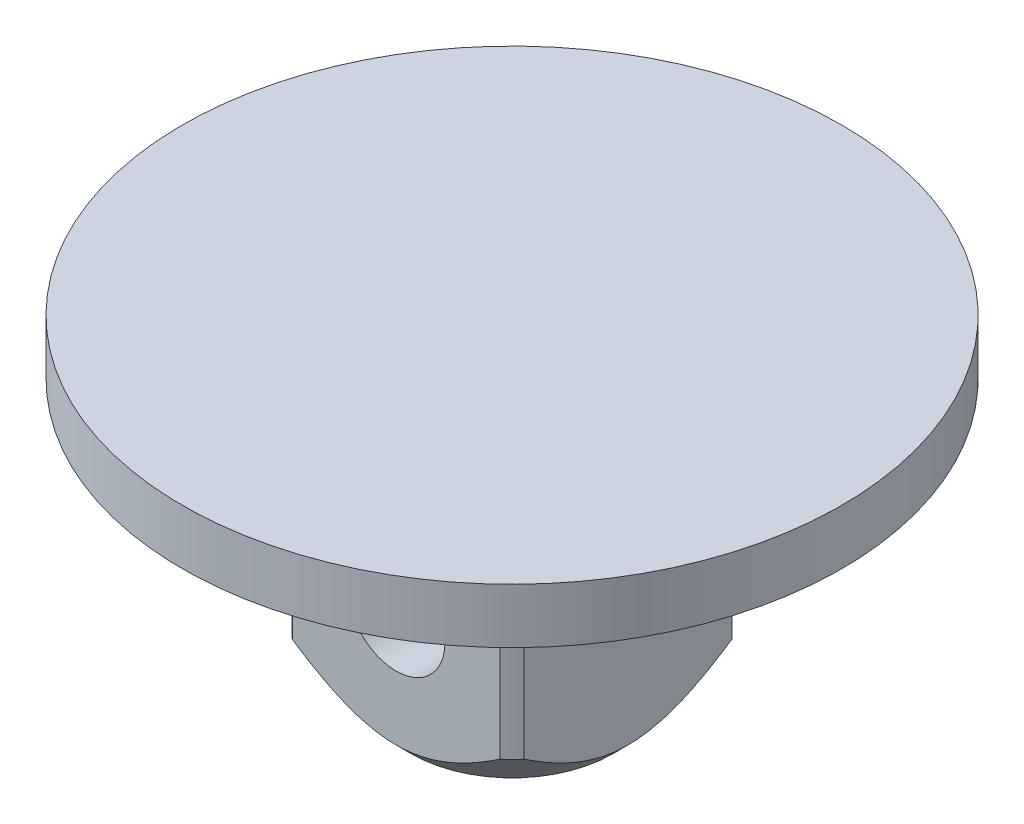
ISO-10303-21;
HEADER;
FILE_DESCRIPTION(('STEP AP214'),'2;1');
FILE_NAME('part.step','',(''),(''),'','','');
FILE_SCHEMA(('AUTOMOTIVE_DESIGN { 1 0 10303 214 1 1 1 1 }'));
ENDSEC;
DATA;
#1=APPLICATION_CONTEXT('core data for automotive mechanical design processes');
#2=APPLICATION_PROTOCOL_DEFINITION('international standard','automotive_design',2000,#1);
#3=PRODUCT_CONTEXT('',#1,'mechanical');
#4=PRODUCT('Part','Part','',(#3));
#5=PRODUCT_RELATED_PRODUCT_CATEGORY('part','',(#4));
#6=PRODUCT_DEFINITION_FORMATION('','',#4);
#7=PRODUCT_DEFINITION_CONTEXT('part definition',#1,'design');
#8=PRODUCT_DEFINITION('design','',#6,#7);
#9=PRODUCT_DEFINITION_SHAPE('','',#8);
#10=(LENGTH_UNIT() NAMED_UNIT(*) SI_UNIT(.MILLI.,.METRE.));
#11=(NAMED_UNIT(*) PLANE_ANGLE_UNIT() SI_UNIT($,.RADIAN.));
#12=(NAMED_UNIT(*) SI_UNIT($,.STERADIAN.) SOLID_ANGLE_UNIT());
#13=UNCERTAINTY_MEASURE_WITH_UNIT(LENGTH_MEASURE(1.E-05),#10,'distance_accuracy_value','');
#14=(GEOMETRIC_REPRESENTATION_CONTEXT(3) GLOBAL_UNCERTAINTY_ASSIGNED_CONTEXT((#13)) GLOBAL_UNIT_ASSIGNED_CONTEXT((#10,
#11,#12)) REPRESENTATION_CONTEXT('',''));
#15=CARTESIAN_POINT('',(0.,0.,0.));
#16=DIRECTION('',(0.,0.,1.));
#17=DIRECTION('',(1.,0.,0.));
#18=AXIS2_PLACEMENT_3D('',#15,#16,#17);
#19=CARTESIAN_POINT('',(0.,0.,0.));
#20=DIRECTION('',(0.,-1.,0.));
#21=DIRECTION('',(0.,0.,-1.));
#22=AXIS2_PLACEMENT_3D('',#19,#20,#21);
#23=CYLINDRICAL_SURFACE('',#22,12.75);
#24=CARTESIAN_POINT('',(0.,0.,0.));
#25=DIRECTION('',(0.,-1.,0.));
#26=DIRECTION('',(0.,0.,-1.));
#27=AXIS2_PLACEMENT_3D('',#24,#25,#26);
#28=CIRCLE('',#27,12.75);
#29=CARTESIAN_POINT('',(0.,0.,-12.75));
#30=VERTEX_POINT('',#29);
#31=EDGE_CURVE('E151',#30,#30,#28,.T.);
#32=ORIENTED_EDGE('',*,*,#31,.T.);
#33=EDGE_LOOP('',(#32));
#34=FACE_BOUND('',#33,.T.);
#35=CARTESIAN_POINT('',(0.,-18.,0.));
#36=DIRECTION('',(0.,-1.,0.));
#37=DIRECTION('',(0.,0.,-1.));
#38=AXIS2_PLACEMENT_3D('',#35,#36,#37);
#39=CIRCLE('',#38,12.75);
#40=CARTESIAN_POINT('',(8.50367567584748,-18.,9.5));
#41=VERTEX_POINT('',#40);
#42=CARTESIAN_POINT('',(9.5,-18.,8.50367567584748));
#43=VERTEX_POINT('',#42);
#44=EDGE_CURVE('E395',#41,#43,#39,.F.);
#45=ORIENTED_EDGE('',*,*,#44,.T.);
#46=DIRECTION('',(0.,-1.,0.));
#47=VECTOR('',#46,1.);
#48=CARTESIAN_POINT('',(9.5,0.,8.50367567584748));
#49=LINE('',#48,#47);
#50=CARTESIAN_POINT('',(9.5,-1.5,8.50367567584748));
#51=VERTEX_POINT('',#50);
#52=EDGE_CURVE('E61',#43,#51,#49,.F.);
#53=ORIENTED_EDGE('',*,*,#52,.T.);
#54=CARTESIAN_POINT('',(0.,-1.5,0.));
#55=DIRECTION('',(0.,-1.,0.));
#56=DIRECTION('',(0.,0.,-1.));
#57=AXIS2_PLACEMENT_3D('',#54,#55,#56);
#58=CIRCLE('',#57,12.75);
#59=CARTESIAN_POINT('',(9.5,-1.5,-8.50367567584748));
#60=VERTEX_POINT('',#59);
#61=EDGE_CURVE('E12',#51,#60,#58,.F.);
#62=ORIENTED_EDGE('',*,*,#61,.T.);
#63=DIRECTION('',(0.,-1.,0.));
#64=VECTOR('',#63,1.);
#65=CARTESIAN_POINT('',(9.5,0.,-8.50367567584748));
#66=LINE('',#65,#64);
#67=CARTESIAN_POINT('',(9.5,-18.,-8.50367567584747));
#68=VERTEX_POINT('',#67);
#69=EDGE_CURVE('E147',#60,#68,#66,.T.);
#70=ORIENTED_EDGE('',*,*,#69,.T.);
#71=CARTESIAN_POINT('',(8.50367567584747,-18.,-9.5));
#72=VERTEX_POINT('',#71);
#73=EDGE_CURVE('E163',#68,#72,#39,.F.);
#74=ORIENTED_EDGE('',*,*,#73,.T.);
#75=DIRECTION('',(0.,-1.,0.));
#76=VECTOR('',#75,1.);
#77=CARTESIAN_POINT('',(8.50367567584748,0.,-9.5));
#78=LINE('',#77,#76);
#79=CARTESIAN_POINT('',(8.50367567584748,-1.5,-9.5));
#80=VERTEX_POINT('',#79);
#81=EDGE_CURVE('E53',#72,#80,#78,.F.);
#82=ORIENTED_EDGE('',*,*,#81,.T.);
#83=CARTESIAN_POINT('',(-8.50367567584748,-1.5,-9.5));
#84=VERTEX_POINT('',#83);
#85=EDGE_CURVE('E46',#80,#84,#58,.F.);
#86=ORIENTED_EDGE('',*,*,#85,.T.);
#87=DIRECTION('',(0.,-1.,0.));
#88=VECTOR('',#87,1.);
#89=CARTESIAN_POINT('',(-8.50367567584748,0.,-9.5));
#90=LINE('',#89,#88);
#91=CARTESIAN_POINT('',(-8.50367567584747,-18.,-9.5));
#92=VERTEX_POINT('',#91);
#93=EDGE_CURVE('E143',#84,#92,#90,.T.);
#94=ORIENTED_EDGE('',*,*,#93,.T.);
#95=CARTESIAN_POINT('',(-9.5,-18.,-8.50367567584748));
#96=VERTEX_POINT('',#95);
#97=EDGE_CURVE('E164',#92,#96,#39,.F.);
#98=ORIENTED_EDGE('',*,*,#97,.T.);
#99=DIRECTION('',(0.,-1.,0.));
#100=VECTOR('',#99,1.);
#101=CARTESIAN_POINT('',(-9.5,0.,-8.50367567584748));
#102=LINE('',#101,#100);
#103=CARTESIAN_POINT('',(-9.5,-1.5,-8.50367567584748));
#104=VERTEX_POINT('',#103);
#105=EDGE_CURVE('E140',#96,#104,#102,.F.);
#106=ORIENTED_EDGE('',*,*,#105,.T.);
#107=CARTESIAN_POINT('',(-9.5,-1.5,8.50367567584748));
#108=VERTEX_POINT('',#107);
#109=EDGE_CURVE('E403',#104,#108,#58,.F.);
#110=ORIENTED_EDGE('',*,*,#109,.T.);
#111=DIRECTION('',(0.,-1.,0.));
#112=VECTOR('',#111,1.);
#113=CARTESIAN_POINT('',(-9.5,0.,8.50367567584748));
#114=LINE('',#113,#112);
#115=CARTESIAN_POINT('',(-9.5,-18.,8.50367567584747));
#116=VERTEX_POINT('',#115);
#117=EDGE_CURVE('E137',#108,#116,#114,.T.);
#118=ORIENTED_EDGE('',*,*,#117,.T.);
#119=CARTESIAN_POINT('',(-8.50367567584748,-18.,9.5));
#120=VERTEX_POINT('',#119);
#121=EDGE_CURVE('E168',#116,#120,#39,.F.);
#122=ORIENTED_EDGE('',*,*,#121,.T.);
#123=DIRECTION('',(0.,-1.,0.));
#124=VECTOR('',#123,1.);
#125=CARTESIAN_POINT('',(-8.50367567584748,0.,9.49999999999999));
#126=LINE('',#125,#124);
#127=CARTESIAN_POINT('',(-8.50367567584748,-1.5,9.5));
#128=VERTEX_POINT('',#127);
#129=EDGE_CURVE('E134',#120,#128,#126,.F.);
#130=ORIENTED_EDGE('',*,*,#129,.T.);
#131=CARTESIAN_POINT('',(8.50367567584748,-1.5,9.5));
#132=VERTEX_POINT('',#131);
#133=EDGE_CURVE('E41',#128,#132,#58,.F.);
#134=ORIENTED_EDGE('',*,*,#133,.T.);
#135=DIRECTION('',(0.,-1.,0.));
#136=VECTOR('',#135,1.);
#137=CARTESIAN_POINT('',(8.50367567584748,0.,9.49999999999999));
#138=LINE('',#137,#136);
#139=EDGE_CURVE('E131',#132,#41,#138,.T.);
#140=ORIENTED_EDGE('',*,*,#139,.T.);
#141=EDGE_LOOP('',(#45,#53,#62,#70,#74,#82,#86,#94,#98,#106,#110,#118,#122,#130,#134,#140));
#142=FACE_BOUND('',#141,.T.);
#143=ADVANCED_FACE('F36',(#34,#142),#23,.T.);
#144=CARTESIAN_POINT('',(0.,-22.5,0.));
#145=DIRECTION('',(0.,1.,0.));
#146=DIRECTION('',(0.,0.,1.));
#147=AXIS2_PLACEMENT_3D('',#144,#145,#146);
#148=CONICAL_SURFACE('',#147,8.25000000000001,0.785398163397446);
#149=CARTESIAN_POINT('',(0.,-22.5,0.));
#150=DIRECTION('',(0.,-1.,0.));
#151=DIRECTION('',(0.,0.,-1.));
#152=AXIS2_PLACEMENT_3D('',#149,#150,#151);
#153=CIRCLE('',#152,8.25000000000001);
#154=CARTESIAN_POINT('',(0.,-22.5,-8.25000000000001));
#155=VERTEX_POINT('',#154);
#156=EDGE_CURVE('E160',#155,#155,#153,.T.);
#157=ORIENTED_EDGE('',*,*,#156,.F.);
#158=EDGE_LOOP('',(#157));
#159=FACE_BOUND('',#158,.T.);
#160=ORIENTED_EDGE('',*,*,#73,.F.);
#161=CARTESIAN_POINT('',(9.5,-10.9725509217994,-17.3463970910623));
#162=CARTESIAN_POINT('',(9.5,-11.1524764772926,-17.1412528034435));
#163=CARTESIAN_POINT('',(9.5,-11.3319885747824,-16.9357459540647));
#164=CARTESIAN_POINT('',(9.5,-11.6900950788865,-16.5239319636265));
#165=CARTESIAN_POINT('',(9.5,-11.8686894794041,-16.3176248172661));
#166=CARTESIAN_POINT('',(9.5,-12.4030033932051,-15.6973397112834));
#167=CARTESIAN_POINT('',(9.5,-12.7572060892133,-15.2820521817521));
#168=CARTESIAN_POINT('',(9.5,-13.4626599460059,-14.444835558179));
#169=CARTESIAN_POINT('',(9.5,-13.8138820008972,-14.0228818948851));
#170=CARTESIAN_POINT('',(9.5,-14.5099447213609,-13.1737810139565));
#171=CARTESIAN_POINT('',(9.5,-14.8547857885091,-12.7466341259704));
#172=CARTESIAN_POINT('',(9.5,-15.5620041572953,-11.8534954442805));
#173=CARTESIAN_POINT('',(9.5,-15.9237483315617,-11.3869993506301));
#174=CARTESIAN_POINT('',(9.5,-16.456976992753,-10.6800887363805));
#175=CARTESIAN_POINT('',(9.5,-16.6331760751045,-10.4432282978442));
#176=CARTESIAN_POINT('',(9.5,-16.9818867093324,-9.96681147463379));
#177=CARTESIAN_POINT('',(9.5,-17.1543983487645,-9.72725515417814));
#178=CARTESIAN_POINT('',(9.5,-17.4946851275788,-9.24566550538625));
#179=CARTESIAN_POINT('',(9.5,-17.6624707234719,-9.00363957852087));
#180=CARTESIAN_POINT('',(9.5,-17.9929430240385,-8.51613891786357));
#181=CARTESIAN_POINT('',(9.5,-18.1556299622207,-8.27066434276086));
#182=CARTESIAN_POINT('',(9.5,-18.4748769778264,-7.77588310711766));
#183=CARTESIAN_POINT('',(9.5,-18.6314393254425,-7.52657791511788));
#184=CARTESIAN_POINT('',(9.5,-18.9372779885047,-7.02355235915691));
#185=CARTESIAN_POINT('',(9.5,-19.086555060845,-6.76983245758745));
#186=CARTESIAN_POINT('',(9.5,-19.3293482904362,-6.34047767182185));
#187=CARTESIAN_POINT('',(9.5,-19.4252525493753,-6.16619443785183));
#188=CARTESIAN_POINT('',(9.5,-19.6124786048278,-5.81518785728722));
#189=CARTESIAN_POINT('',(9.5,-19.7038003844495,-5.63846450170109));
#190=CARTESIAN_POINT('',(9.5,-19.9700163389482,-5.10426622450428));
#191=CARTESIAN_POINT('',(9.5,-20.1371224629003,-4.74283049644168));
#192=CARTESIAN_POINT('',(9.5,-20.4425108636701,-4.01283958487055));
#193=CARTESIAN_POINT('',(9.5,-20.5811087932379,-3.64441798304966));
#194=CARTESIAN_POINT('',(9.5,-20.8245146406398,-2.89652766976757));
#195=CARTESIAN_POINT('',(9.5,-20.9293424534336,-2.51706560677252));
#196=CARTESIAN_POINT('',(9.5,-21.0744019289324,-1.85496117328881));
#197=CARTESIAN_POINT('',(9.5,-21.1244751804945,-1.57447606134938));
#198=CARTESIAN_POINT('',(9.5,-21.200519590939,-1.0102532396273));
#199=CARTESIAN_POINT('',(9.5,-21.2264958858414,-0.726516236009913));
#200=CARTESIAN_POINT('',(9.5,-21.2529103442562,-0.158349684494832));
#201=CARTESIAN_POINT('',(9.5,-21.2533943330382,0.126077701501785));
#202=CARTESIAN_POINT('',(9.5,-21.2289219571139,0.693857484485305));
#203=CARTESIAN_POINT('',(9.5,-21.2039612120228,0.977209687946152));
#204=CARTESIAN_POINT('',(9.5,-21.1220660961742,1.60052485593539));
#205=CARTESIAN_POINT('',(9.5,-21.0594711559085,1.93974243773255));
#206=CARTESIAN_POINT('',(9.5,-20.9031669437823,2.61091797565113));
#207=CARTESIAN_POINT('',(9.5,-20.8094469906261,2.94287339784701));
#208=CARTESIAN_POINT('',(9.5,-20.6486354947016,3.43691021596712));
#209=CARTESIAN_POINT('',(9.5,-20.5911325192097,3.60220676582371));
#210=CARTESIAN_POINT('',(9.5,-20.4701045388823,3.93059023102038));
#211=CARTESIAN_POINT('',(9.5,-20.4065794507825,4.093677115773));
#212=CARTESIAN_POINT('',(9.5,-20.274161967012,4.41758177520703));
#213=CARTESIAN_POINT('',(9.5,-20.2052714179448,4.57840030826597));
#214=CARTESIAN_POINT('',(9.5,-20.0626826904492,4.89787389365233));
#215=CARTESIAN_POINT('',(9.5,-19.9889847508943,5.05652905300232));
#216=CARTESIAN_POINT('',(9.5,-19.7509277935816,5.55131273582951));
#217=CARTESIAN_POINT('',(9.5,-19.5789100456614,5.88377020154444));
#218=CARTESIAN_POINT('',(9.5,-19.2195720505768,6.54035613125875));
#219=CARTESIAN_POINT('',(9.5,-19.0322463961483,6.86448159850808));
#220=CARTESIAN_POINT('',(9.5,-18.6453449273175,7.50587522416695));
#221=CARTESIAN_POINT('',(9.5,-18.4457535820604,7.82313397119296));
#222=CARTESIAN_POINT('',(9.5,-18.0370568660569,8.45137901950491));
#223=CARTESIAN_POINT('',(9.5,-17.8279526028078,8.76236604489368));
#224=CARTESIAN_POINT('',(9.5,-17.4007438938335,9.38099057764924));
#225=CARTESIAN_POINT('',(9.5,-17.1825908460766,9.68859441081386));
#226=CARTESIAN_POINT('',(9.5,-16.7399971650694,10.2992431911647));
#227=CARTESIAN_POINT('',(9.5,-16.5155563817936,10.6022880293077));
#228=CARTESIAN_POINT('',(9.5,-16.0616781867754,11.2042788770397));
#229=CARTESIAN_POINT('',(9.5,-15.8322443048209,11.5032275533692));
#230=CARTESIAN_POINT('',(9.5,-15.3691090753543,12.0977890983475));
#231=CARTESIAN_POINT('',(9.5,-15.1354077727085,12.3934020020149));
#232=CARTESIAN_POINT('',(9.5,-14.4836404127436,13.2076464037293));
#233=CARTESIAN_POINT('',(9.5,-14.061787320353,13.7232462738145));
#234=CARTESIAN_POINT('',(9.5,-13.2097174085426,14.7476140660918));
#235=CARTESIAN_POINT('',(9.5,-12.7794991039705,15.2563807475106));
#236=CARTESIAN_POINT('',(9.5,-11.9184280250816,16.2617502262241));
#237=CARTESIAN_POINT('',(9.5,-11.4876590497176,16.7584248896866));
#238=CARTESIAN_POINT('',(9.5,-10.8379078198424,17.5001590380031));
#239=CARTESIAN_POINT('',(9.5,-10.6207538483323,17.7468245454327));
#240=CARTESIAN_POINT('',(9.5,-10.1853529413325,18.2391858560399));
#241=CARTESIAN_POINT('',(9.5,-9.96710601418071,18.4848816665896));
#242=CARTESIAN_POINT('',(9.5,-9.74837346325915,18.7301446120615));
#243=B_SPLINE_CURVE_WITH_KNOTS('',3,(#161,#162,#163,#164,#165,#166,#167,#168,#169,#170,#171,
#172,#173,#174,#175,#176,#177,#178,#179,#180,#181,#182,#183,#184,#185,#186,#187,#188,#189,#190,
#191,#192,#193,#194,#195,#196,#197,#198,#199,#200,#201,#202,#203,#204,#205,#206,#207,#208,#209,
#210,#211,#212,#213,#214,#215,#216,#217,#218,#219,#220,#221,#222,#223,#224,#225,#226,#227,#228,
#229,#230,#231,#232,#233,#234,#235,#236,#237,#238,#239,#240,#241,#242),.UNSPECIFIED.,.F.,.F.,(4,
2,2,2,2,2,2,2,2,2,2,2,2,2,2,2,2,2,2,2,2,2,2,2,2,2,2,2,2,2,2,2,2,2,2,2,2,2,2,2,4),(0.,
0.818605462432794,1.63721635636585,3.27465416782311,4.92160571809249,6.56845326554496,
8.33922824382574,9.2248305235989,10.1104117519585,10.993848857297,11.8772454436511,
12.7603114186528,13.6432854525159,14.2400052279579,14.8367272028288,16.0304039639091,
17.2100529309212,18.3890056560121,19.2428440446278,20.096500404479,20.9486221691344,
21.8008906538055,22.8339993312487,23.8674629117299,24.3924069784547,24.9173583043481,
25.4421297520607,25.9668751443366,27.0892671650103,28.212057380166,29.3362997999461,
30.4604116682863,31.5916408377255,32.7228970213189,33.8533779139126,34.983846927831,
36.9822730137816,38.981057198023,40.9533804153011,41.9392772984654,42.9251666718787),.UNSPECIFIED.);
#244=EDGE_CURVE('E197',#68,#43,#243,.T.);
#245=ORIENTED_EDGE('',*,*,#244,.T.);
#246=ORIENTED_EDGE('',*,*,#44,.F.);
#247=CARTESIAN_POINT('',(-17.3463970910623,-10.9725509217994,9.5));
#248=CARTESIAN_POINT('',(-17.1412528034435,-11.1524764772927,9.5));
#249=CARTESIAN_POINT('',(-16.9357459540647,-11.3319885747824,9.5));
#250=CARTESIAN_POINT('',(-16.5239319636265,-11.6900950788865,9.5));
#251=CARTESIAN_POINT('',(-16.3176248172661,-11.8686894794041,9.5));
#252=CARTESIAN_POINT('',(-15.6973397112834,-12.4030033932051,9.5));
#253=CARTESIAN_POINT('',(-15.2820521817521,-12.7572060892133,9.5));
#254=CARTESIAN_POINT('',(-14.444835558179,-13.4626599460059,9.5));
#255=CARTESIAN_POINT('',(-14.0228818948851,-13.8138820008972,9.5));
#256=CARTESIAN_POINT('',(-13.1737810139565,-14.5099447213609,9.5));
#257=CARTESIAN_POINT('',(-12.7466341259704,-14.8547857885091,9.5));
#258=CARTESIAN_POINT('',(-11.8534954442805,-15.5620041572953,9.5));
#259=CARTESIAN_POINT('',(-11.38699935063,-15.9237483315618,9.5));
#260=CARTESIAN_POINT('',(-10.6800887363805,-16.456976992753,9.5));
#261=CARTESIAN_POINT('',(-10.4432282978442,-16.6331760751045,9.5));
#262=CARTESIAN_POINT('',(-9.96681147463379,-16.9818867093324,9.5));
#263=CARTESIAN_POINT('',(-9.72725515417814,-17.1543983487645,9.5));
#264=CARTESIAN_POINT('',(-9.24566550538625,-17.4946851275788,9.5));
#265=CARTESIAN_POINT('',(-9.00363957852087,-17.6624707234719,9.5));
#266=CARTESIAN_POINT('',(-8.51613891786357,-17.9929430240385,9.5));
#267=CARTESIAN_POINT('',(-8.27066434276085,-18.1556299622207,9.5));
#268=CARTESIAN_POINT('',(-7.77588310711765,-18.4748769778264,9.5));
#269=CARTESIAN_POINT('',(-7.52657791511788,-18.6314393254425,9.5));
#270=CARTESIAN_POINT('',(-7.02355235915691,-18.9372779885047,9.5));
#271=CARTESIAN_POINT('',(-6.76983245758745,-19.086555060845,9.5));
#272=CARTESIAN_POINT('',(-6.34047767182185,-19.3293482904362,9.5));
#273=CARTESIAN_POINT('',(-6.16619443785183,-19.4252525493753,9.5));
#274=CARTESIAN_POINT('',(-5.81518785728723,-19.6124786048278,9.5));
#275=CARTESIAN_POINT('',(-5.63846450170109,-19.7038003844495,9.5));
#276=CARTESIAN_POINT('',(-5.10426622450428,-19.9700163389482,9.5));
#277=CARTESIAN_POINT('',(-4.74283049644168,-20.1371224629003,9.5));
#278=CARTESIAN_POINT('',(-4.01283958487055,-20.4425108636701,9.5));
#279=CARTESIAN_POINT('',(-3.64441798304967,-20.5811087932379,9.5));
#280=CARTESIAN_POINT('',(-2.89652766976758,-20.8245146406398,9.5));
#281=CARTESIAN_POINT('',(-2.51706560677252,-20.9293424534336,9.5));
#282=CARTESIAN_POINT('',(-1.85496117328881,-21.0744019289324,9.5));
#283=CARTESIAN_POINT('',(-1.57447606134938,-21.1244751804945,9.5));
#284=CARTESIAN_POINT('',(-1.01025323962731,-21.200519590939,9.5));
#285=CARTESIAN_POINT('',(-0.726516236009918,-21.2264958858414,9.5));
#286=CARTESIAN_POINT('',(-0.158349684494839,-21.2529103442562,9.5));
#287=CARTESIAN_POINT('',(0.126077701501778,-21.2533943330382,9.5));
#288=CARTESIAN_POINT('',(0.693857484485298,-21.2289219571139,9.5));
#289=CARTESIAN_POINT('',(0.977209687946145,-21.2039612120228,9.5));
#290=CARTESIAN_POINT('',(1.60052485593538,-21.1220660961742,9.5));
#291=CARTESIAN_POINT('',(1.93974243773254,-21.0594711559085,9.5));
#292=CARTESIAN_POINT('',(2.61091797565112,-20.9031669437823,9.5));
#293=CARTESIAN_POINT('',(2.942873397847,-20.8094469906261,9.5));
#294=CARTESIAN_POINT('',(3.43691021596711,-20.6486354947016,9.5));
#295=CARTESIAN_POINT('',(3.60220676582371,-20.5911325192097,9.5));
#296=CARTESIAN_POINT('',(3.93059023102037,-20.4701045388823,9.5));
#297=CARTESIAN_POINT('',(4.09367711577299,-20.4065794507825,9.5));
#298=CARTESIAN_POINT('',(4.41758177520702,-20.274161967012,9.5));
#299=CARTESIAN_POINT('',(4.57840030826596,-20.2052714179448,9.5));
#300=CARTESIAN_POINT('',(4.89787389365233,-20.0626826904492,9.5));
#301=CARTESIAN_POINT('',(5.05652905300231,-19.9889847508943,9.5));
#302=CARTESIAN_POINT('',(5.55131273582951,-19.7509277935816,9.5));
#303=CARTESIAN_POINT('',(5.88377020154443,-19.5789100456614,9.5));
#304=CARTESIAN_POINT('',(6.54035613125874,-19.2195720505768,9.5));
#305=CARTESIAN_POINT('',(6.86448159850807,-19.0322463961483,9.5));
#306=CARTESIAN_POINT('',(7.50587522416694,-18.6453449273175,9.5));
#307=CARTESIAN_POINT('',(7.82313397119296,-18.4457535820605,9.5));
#308=CARTESIAN_POINT('',(8.45137901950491,-18.0370568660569,9.5));
#309=CARTESIAN_POINT('',(8.76236604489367,-17.8279526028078,9.5));
#310=CARTESIAN_POINT('',(9.38099057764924,-17.4007438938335,9.5));
#311=CARTESIAN_POINT('',(9.68859441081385,-17.1825908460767,9.5));
#312=CARTESIAN_POINT('',(10.2992431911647,-16.7399971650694,9.5));
#313=CARTESIAN_POINT('',(10.6022880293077,-16.5155563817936,9.5));
#314=CARTESIAN_POINT('',(11.2042788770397,-16.0616781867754,9.5));
#315=CARTESIAN_POINT('',(11.5032275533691,-15.8322443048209,9.5));
#316=CARTESIAN_POINT('',(12.0977890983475,-15.3691090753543,9.5));
#317=CARTESIAN_POINT('',(12.3934020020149,-15.1354077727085,9.5));
#318=CARTESIAN_POINT('',(13.2076464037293,-14.4836404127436,9.5));
#319=CARTESIAN_POINT('',(13.7232462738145,-14.061787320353,9.5));
#320=CARTESIAN_POINT('',(14.7476140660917,-13.2097174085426,9.5));
#321=CARTESIAN_POINT('',(15.2563807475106,-12.7794991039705,9.5));
#322=CARTESIAN_POINT('',(16.261750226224,-11.9184280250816,9.5));
#323=CARTESIAN_POINT('',(16.7584248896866,-11.4876590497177,9.5));
#324=CARTESIAN_POINT('',(17.5001590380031,-10.8379078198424,9.5));
#325=CARTESIAN_POINT('',(17.7468245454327,-10.6207538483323,9.5));
#326=CARTESIAN_POINT('',(18.2391858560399,-10.1853529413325,9.5));
#327=CARTESIAN_POINT('',(18.4848816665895,-9.96710601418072,9.5));
#328=CARTESIAN_POINT('',(18.7301446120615,-9.74837346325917,9.5));
#329=B_SPLINE_CURVE_WITH_KNOTS('',3,(#247,#248,#249,#250,#251,#252,#253,#254,#255,#256,#257,
#258,#259,#260,#261,#262,#263,#264,#265,#266,#267,#268,#269,#270,#271,#272,#273,#274,#275,#276,
#277,#278,#279,#280,#281,#282,#283,#284,#285,#286,#287,#288,#289,#290,#291,#292,#293,#294,#295,
#296,#297,#298,#299,#300,#301,#302,#303,#304,#305,#306,#307,#308,#309,#310,#311,#312,#313,#314,
#315,#316,#317,#318,#319,#320,#321,#322,#323,#324,#325,#326,#327,#328),.UNSPECIFIED.,.F.,.F.,(4,
2,2,2,2,2,2,2,2,2,2,2,2,2,2,2,2,2,2,2,2,2,2,2,2,2,2,2,2,2,2,2,2,2,2,2,2,2,2,2,4),(0.,
0.818605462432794,1.63721635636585,3.27465416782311,4.92160571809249,6.56845326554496,
8.33922824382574,9.2248305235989,10.1104117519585,10.993848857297,11.8772454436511,
12.7603114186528,13.6432854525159,14.2400052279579,14.8367272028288,16.0304039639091,
17.2100529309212,18.3890056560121,19.2428440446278,20.096500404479,20.9486221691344,
21.8008906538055,22.8339993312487,23.8674629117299,24.3924069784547,24.9173583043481,
25.4421297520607,25.9668751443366,27.0892671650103,28.212057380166,29.3362997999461,
30.4604116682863,31.5916408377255,32.7228970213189,33.8533779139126,34.9838469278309,
36.9822730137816,38.981057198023,40.9533804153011,41.9392772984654,42.9251666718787),.UNSPECIFIED.);
#330=EDGE_CURVE('E167',#41,#120,#329,.F.);
#331=ORIENTED_EDGE('',*,*,#330,.T.);
#332=ORIENTED_EDGE('',*,*,#121,.F.);
#333=CARTESIAN_POINT('',(-9.5,-10.9725509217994,-17.3463970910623));
#334=CARTESIAN_POINT('',(-9.5,-11.1524764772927,-17.1412528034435));
#335=CARTESIAN_POINT('',(-9.5,-11.3319885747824,-16.9357459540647));
#336=CARTESIAN_POINT('',(-9.5,-11.6900950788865,-16.5239319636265));
#337=CARTESIAN_POINT('',(-9.5,-11.8686894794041,-16.3176248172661));
#338=CARTESIAN_POINT('',(-9.5,-12.4030033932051,-15.6973397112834));
#339=CARTESIAN_POINT('',(-9.5,-12.7572060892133,-15.2820521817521));
#340=CARTESIAN_POINT('',(-9.5,-13.4626599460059,-14.444835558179));
#341=CARTESIAN_POINT('',(-9.5,-13.8138820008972,-14.0228818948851));
#342=CARTESIAN_POINT('',(-9.5,-14.5099447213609,-13.1737810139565));
#343=CARTESIAN_POINT('',(-9.5,-14.8547857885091,-12.7466341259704));
#344=CARTESIAN_POINT('',(-9.5,-15.5620041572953,-11.8534954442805));
#345=CARTESIAN_POINT('',(-9.5,-15.9237483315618,-11.3869993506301));
#346=CARTESIAN_POINT('',(-9.5,-16.456976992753,-10.6800887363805));
#347=CARTESIAN_POINT('',(-9.5,-16.6331760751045,-10.4432282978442));
#348=CARTESIAN_POINT('',(-9.5,-16.9818867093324,-9.96681147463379));
#349=CARTESIAN_POINT('',(-9.5,-17.1543983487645,-9.72725515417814));
#350=CARTESIAN_POINT('',(-9.5,-17.4946851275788,-9.24566550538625));
#351=CARTESIAN_POINT('',(-9.5,-17.6624707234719,-9.00363957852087));
#352=CARTESIAN_POINT('',(-9.5,-17.9929430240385,-8.51613891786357));
#353=CARTESIAN_POINT('',(-9.5,-18.1556299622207,-8.27066434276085));
#354=CARTESIAN_POINT('',(-9.5,-18.4748769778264,-7.77588310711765));
#355=CARTESIAN_POINT('',(-9.5,-18.6314393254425,-7.52657791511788));
#356=CARTESIAN_POINT('',(-9.5,-18.9372779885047,-7.0235523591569));
#357=CARTESIAN_POINT('',(-9.5,-19.086555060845,-6.76983245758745));
#358=CARTESIAN_POINT('',(-9.5,-19.3293482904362,-6.34047767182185));
#359=CARTESIAN_POINT('',(-9.5,-19.4252525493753,-6.16619443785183));
#360=CARTESIAN_POINT('',(-9.5,-19.6124786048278,-5.81518785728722));
#361=CARTESIAN_POINT('',(-9.5,-19.7038003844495,-5.63846450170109));
#362=CARTESIAN_POINT('',(-9.5,-19.9700163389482,-5.10426622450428));
#363=CARTESIAN_POINT('',(-9.5,-20.1371224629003,-4.74283049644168));
#364=CARTESIAN_POINT('',(-9.5,-20.4425108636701,-4.01283958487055));
#365=CARTESIAN_POINT('',(-9.5,-20.5811087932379,-3.64441798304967));
#366=CARTESIAN_POINT('',(-9.5,-20.8245146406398,-2.89652766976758));
#367=CARTESIAN_POINT('',(-9.5,-20.9293424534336,-2.51706560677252));
#368=CARTESIAN_POINT('',(-9.5,-21.0744019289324,-1.85496117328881));
#369=CARTESIAN_POINT('',(-9.5,-21.1244751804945,-1.57447606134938));
#370=CARTESIAN_POINT('',(-9.5,-21.200519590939,-1.01025323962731));
#371=CARTESIAN_POINT('',(-9.5,-21.2264958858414,-0.726516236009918));
#372=CARTESIAN_POINT('',(-9.5,-21.2529103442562,-0.158349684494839));
#373=CARTESIAN_POINT('',(-9.5,-21.2533943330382,0.126077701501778));
#374=CARTESIAN_POINT('',(-9.5,-21.2289219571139,0.693857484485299));
#375=CARTESIAN_POINT('',(-9.5,-21.2039612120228,0.977209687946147));
#376=CARTESIAN_POINT('',(-9.5,-21.1220660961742,1.60052485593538));
#377=CARTESIAN_POINT('',(-9.5,-21.0594711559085,1.93974243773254));
#378=CARTESIAN_POINT('',(-9.5,-20.9031669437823,2.61091797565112));
#379=CARTESIAN_POINT('',(-9.5,-20.8094469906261,2.942873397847));
#380=CARTESIAN_POINT('',(-9.5,-20.6486354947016,3.43691021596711));
#381=CARTESIAN_POINT('',(-9.5,-20.5911325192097,3.60220676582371));
#382=CARTESIAN_POINT('',(-9.5,-20.4701045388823,3.93059023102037));
#383=CARTESIAN_POINT('',(-9.5,-20.4065794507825,4.09367711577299));
#384=CARTESIAN_POINT('',(-9.5,-20.274161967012,4.41758177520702));
#385=CARTESIAN_POINT('',(-9.5,-20.2052714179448,4.57840030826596));
#386=CARTESIAN_POINT('',(-9.5,-20.0626826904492,4.89787389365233));
#387=CARTESIAN_POINT('',(-9.5,-19.9889847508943,5.05652905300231));
#388=CARTESIAN_POINT('',(-9.5,-19.7509277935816,5.55131273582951));
#389=CARTESIAN_POINT('',(-9.5,-19.5789100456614,5.88377020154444));
#390=CARTESIAN_POINT('',(-9.5,-19.2195720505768,6.54035613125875));
#391=CARTESIAN_POINT('',(-9.5,-19.0322463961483,6.86448159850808));
#392=CARTESIAN_POINT('',(-9.5,-18.6453449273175,7.50587522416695));
#393=CARTESIAN_POINT('',(-9.5,-18.4457535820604,7.82313397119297));
#394=CARTESIAN_POINT('',(-9.5,-18.0370568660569,8.45137901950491));
#395=CARTESIAN_POINT('',(-9.5,-17.8279526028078,8.76236604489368));
#396=CARTESIAN_POINT('',(-9.5,-17.4007438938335,9.38099057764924));
#397=CARTESIAN_POINT('',(-9.5,-17.1825908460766,9.68859441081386));
#398=CARTESIAN_POINT('',(-9.5,-16.7399971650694,10.2992431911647));
#399=CARTESIAN_POINT('',(-9.5,-16.5155563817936,10.6022880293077));
#400=CARTESIAN_POINT('',(-9.5,-16.0616781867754,11.2042788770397));
#401=CARTESIAN_POINT('',(-9.5,-15.8322443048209,11.5032275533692));
#402=CARTESIAN_POINT('',(-9.5,-15.3691090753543,12.0977890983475));
#403=CARTESIAN_POINT('',(-9.5,-15.1354077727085,12.3934020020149));
#404=CARTESIAN_POINT('',(-9.5,-14.4836404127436,13.2076464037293));
#405=CARTESIAN_POINT('',(-9.5,-14.061787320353,13.7232462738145));
#406=CARTESIAN_POINT('',(-9.5,-13.2097174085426,14.7476140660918));
#407=CARTESIAN_POINT('',(-9.5,-12.7794991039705,15.2563807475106));
#408=CARTESIAN_POINT('',(-9.5,-11.9184280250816,16.2617502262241));
#409=CARTESIAN_POINT('',(-9.5,-11.4876590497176,16.7584248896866));
#410=CARTESIAN_POINT('',(-9.5,-10.8379078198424,17.5001590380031));
#411=CARTESIAN_POINT('',(-9.5,-10.6207538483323,17.7468245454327));
#412=CARTESIAN_POINT('',(-9.5,-10.1853529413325,18.2391858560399));
#413=CARTESIAN_POINT('',(-9.5,-9.96710601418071,18.4848816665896));
#414=CARTESIAN_POINT('',(-9.5,-9.74837346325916,18.7301446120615));
#415=B_SPLINE_CURVE_WITH_KNOTS('',3,(#333,#334,#335,#336,#337,#338,#339,#340,#341,#342,#343,
#344,#345,#346,#347,#348,#349,#350,#351,#352,#353,#354,#355,#356,#357,#358,#359,#360,#361,#362,
#363,#364,#365,#366,#367,#368,#369,#370,#371,#372,#373,#374,#375,#376,#377,#378,#379,#380,#381,
#382,#383,#384,#385,#386,#387,#388,#389,#390,#391,#392,#393,#394,#395,#396,#397,#398,#399,#400,
#401,#402,#403,#404,#405,#406,#407,#408,#409,#410,#411,#412,#413,#414),.UNSPECIFIED.,.F.,.F.,(4,
2,2,2,2,2,2,2,2,2,2,2,2,2,2,2,2,2,2,2,2,2,2,2,2,2,2,2,2,2,2,2,2,2,2,2,2,2,2,2,4),(0.,
0.818605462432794,1.63721635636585,3.27465416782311,4.92160571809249,6.56845326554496,
8.33922824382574,9.2248305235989,10.1104117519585,10.993848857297,11.8772454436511,
12.7603114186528,13.6432854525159,14.2400052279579,14.8367272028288,16.0304039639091,
17.2100529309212,18.3890056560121,19.2428440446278,20.096500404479,20.9486221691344,
21.8008906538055,22.8339993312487,23.8674629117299,24.3924069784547,24.9173583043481,
25.4421297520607,25.9668751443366,27.0892671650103,28.212057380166,29.3362997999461,
30.4604116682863,31.5916408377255,32.7228970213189,33.8533779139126,34.983846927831,
36.9822730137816,38.981057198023,40.9533804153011,41.9392772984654,42.9251666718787),.UNSPECIFIED.);
#416=EDGE_CURVE('E175',#116,#96,#415,.F.);
#417=ORIENTED_EDGE('',*,*,#416,.T.);
#418=ORIENTED_EDGE('',*,*,#97,.F.);
#419=CARTESIAN_POINT('',(-17.3463970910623,-10.9725509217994,-9.5));
#420=CARTESIAN_POINT('',(-17.1412528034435,-11.1524764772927,-9.5));
#421=CARTESIAN_POINT('',(-16.9357459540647,-11.3319885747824,-9.5));
#422=CARTESIAN_POINT('',(-16.5239319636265,-11.6900950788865,-9.5));
#423=CARTESIAN_POINT('',(-16.3176248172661,-11.8686894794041,-9.5));
#424=CARTESIAN_POINT('',(-15.6973397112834,-12.4030033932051,-9.5));
#425=CARTESIAN_POINT('',(-15.2820521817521,-12.7572060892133,-9.5));
#426=CARTESIAN_POINT('',(-14.444835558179,-13.4626599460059,-9.5));
#427=CARTESIAN_POINT('',(-14.0228818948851,-13.8138820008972,-9.5));
#428=CARTESIAN_POINT('',(-13.1737810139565,-14.5099447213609,-9.5));
#429=CARTESIAN_POINT('',(-12.7466341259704,-14.8547857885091,-9.5));
#430=CARTESIAN_POINT('',(-11.8534954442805,-15.5620041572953,-9.5));
#431=CARTESIAN_POINT('',(-11.38699935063,-15.9237483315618,-9.5));
#432=CARTESIAN_POINT('',(-10.6800887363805,-16.456976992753,-9.5));
#433=CARTESIAN_POINT('',(-10.4432282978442,-16.6331760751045,-9.5));
#434=CARTESIAN_POINT('',(-9.96681147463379,-16.9818867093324,-9.5));
#435=CARTESIAN_POINT('',(-9.72725515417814,-17.1543983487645,-9.5));
#436=CARTESIAN_POINT('',(-9.24566550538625,-17.4946851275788,-9.5));
#437=CARTESIAN_POINT('',(-9.00363957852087,-17.6624707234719,-9.5));
#438=CARTESIAN_POINT('',(-8.51613891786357,-17.9929430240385,-9.5));
#439=CARTESIAN_POINT('',(-8.27066434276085,-18.1556299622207,-9.5));
#440=CARTESIAN_POINT('',(-7.77588310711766,-18.4748769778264,-9.5));
#441=CARTESIAN_POINT('',(-7.52657791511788,-18.6314393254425,-9.5));
#442=CARTESIAN_POINT('',(-7.0235523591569,-18.9372779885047,-9.5));
#443=CARTESIAN_POINT('',(-6.76983245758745,-19.086555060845,-9.5));
#444=CARTESIAN_POINT('',(-6.34047767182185,-19.3293482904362,-9.5));
#445=CARTESIAN_POINT('',(-6.16619443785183,-19.4252525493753,-9.5));
#446=CARTESIAN_POINT('',(-5.81518785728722,-19.6124786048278,-9.5));
#447=CARTESIAN_POINT('',(-5.63846450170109,-19.7038003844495,-9.5));
#448=CARTESIAN_POINT('',(-5.10426622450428,-19.9700163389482,-9.5));
#449=CARTESIAN_POINT('',(-4.74283049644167,-20.1371224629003,-9.5));
#450=CARTESIAN_POINT('',(-4.01283958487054,-20.4425108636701,-9.5));
#451=CARTESIAN_POINT('',(-3.64441798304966,-20.5811087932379,-9.5));
#452=CARTESIAN_POINT('',(-2.89652766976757,-20.8245146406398,-9.5));
#453=CARTESIAN_POINT('',(-2.51706560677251,-20.9293424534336,-9.5));
#454=CARTESIAN_POINT('',(-1.8549611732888,-21.0744019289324,-9.5));
#455=CARTESIAN_POINT('',(-1.57447606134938,-21.1244751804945,-9.5));
#456=CARTESIAN_POINT('',(-1.0102532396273,-21.200519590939,-9.5));
#457=CARTESIAN_POINT('',(-0.726516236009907,-21.2264958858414,-9.5));
#458=CARTESIAN_POINT('',(-0.158349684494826,-21.2529103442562,-9.5));
#459=CARTESIAN_POINT('',(0.126077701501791,-21.2533943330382,-9.5));
#460=CARTESIAN_POINT('',(0.693857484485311,-21.2289219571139,-9.5));
#461=CARTESIAN_POINT('',(0.977209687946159,-21.2039612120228,-9.5));
#462=CARTESIAN_POINT('',(1.60052485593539,-21.1220660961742,-9.5));
#463=CARTESIAN_POINT('',(1.93974243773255,-21.0594711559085,-9.5));
#464=CARTESIAN_POINT('',(2.61091797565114,-20.9031669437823,-9.5));
#465=CARTESIAN_POINT('',(2.94287339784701,-20.8094469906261,-9.5));
#466=CARTESIAN_POINT('',(3.43691021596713,-20.6486354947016,-9.5));
#467=CARTESIAN_POINT('',(3.60220676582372,-20.5911325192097,-9.5));
#468=CARTESIAN_POINT('',(3.93059023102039,-20.4701045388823,-9.5));
#469=CARTESIAN_POINT('',(4.093677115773,-20.4065794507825,-9.5));
#470=CARTESIAN_POINT('',(4.41758177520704,-20.274161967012,-9.5));
#471=CARTESIAN_POINT('',(4.57840030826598,-20.2052714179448,-9.5));
#472=CARTESIAN_POINT('',(4.89787389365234,-20.0626826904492,-9.5));
#473=CARTESIAN_POINT('',(5.05652905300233,-19.9889847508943,-9.5));
#474=CARTESIAN_POINT('',(5.55131273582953,-19.7509277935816,-9.5));
#475=CARTESIAN_POINT('',(5.88377020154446,-19.5789100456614,-9.5));
#476=CARTESIAN_POINT('',(6.54035613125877,-19.2195720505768,-9.5));
#477=CARTESIAN_POINT('',(6.8644815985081,-19.0322463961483,-9.5));
#478=CARTESIAN_POINT('',(7.50587522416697,-18.6453449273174,-9.5));
#479=CARTESIAN_POINT('',(7.823133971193,-18.4457535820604,-9.5));
#480=CARTESIAN_POINT('',(8.45137901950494,-18.0370568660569,-9.5));
#481=CARTESIAN_POINT('',(8.76236604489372,-17.8279526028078,-9.5));
#482=CARTESIAN_POINT('',(9.38099057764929,-17.4007438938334,-9.5));
#483=CARTESIAN_POINT('',(9.6885944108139,-17.1825908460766,-9.5));
#484=CARTESIAN_POINT('',(10.2992431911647,-16.7399971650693,-9.5));
#485=CARTESIAN_POINT('',(10.6022880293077,-16.5155563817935,-9.5));
#486=CARTESIAN_POINT('',(11.2042788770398,-16.0616781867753,-9.5));
#487=CARTESIAN_POINT('',(11.5032275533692,-15.8322443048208,-9.5));
#488=CARTESIAN_POINT('',(12.0977890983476,-15.3691090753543,-9.5));
#489=CARTESIAN_POINT('',(12.3934020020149,-15.1354077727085,-9.5));
#490=CARTESIAN_POINT('',(13.2076464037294,-14.4836404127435,-9.5));
#491=CARTESIAN_POINT('',(13.7232462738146,-14.061787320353,-9.5));
#492=CARTESIAN_POINT('',(14.7476140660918,-13.2097174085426,-9.5));
#493=CARTESIAN_POINT('',(15.2563807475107,-12.7794991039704,-9.5));
#494=CARTESIAN_POINT('',(16.2617502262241,-11.9184280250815,-9.5));
#495=CARTESIAN_POINT('',(16.7584248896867,-11.4876590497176,-9.5));
#496=CARTESIAN_POINT('',(17.5001590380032,-10.8379078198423,-9.5));
#497=CARTESIAN_POINT('',(17.7468245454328,-10.6207538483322,-9.5));
#498=CARTESIAN_POINT('',(18.23918585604,-10.1853529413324,-9.5));
#499=CARTESIAN_POINT('',(18.4848816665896,-9.96710601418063,-9.5));
#500=CARTESIAN_POINT('',(18.7301446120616,-9.74837346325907,-9.5));
#501=B_SPLINE_CURVE_WITH_KNOTS('',3,(#419,#420,#421,#422,#423,#424,#425,#426,#427,#428,#429,
#430,#431,#432,#433,#434,#435,#436,#437,#438,#439,#440,#441,#442,#443,#444,#445,#446,#447,#448,
#449,#450,#451,#452,#453,#454,#455,#456,#457,#458,#459,#460,#461,#462,#463,#464,#465,#466,#467,
#468,#469,#470,#471,#472,#473,#474,#475,#476,#477,#478,#479,#480,#481,#482,#483,#484,#485,#486,
#487,#488,#489,#490,#491,#492,#493,#494,#495,#496,#497,#498,#499,#500),.UNSPECIFIED.,.F.,.F.,(4,
2,2,2,2,2,2,2,2,2,2,2,2,2,2,2,2,2,2,2,2,2,2,2,2,2,2,2,2,2,2,2,2,2,2,2,2,2,2,2,4),(0.,
0.818605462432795,1.63721635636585,3.27465416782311,4.92160571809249,6.56845326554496,
8.33922824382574,9.2248305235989,10.1104117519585,10.993848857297,11.8772454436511,
12.7603114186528,13.6432854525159,14.2400052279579,14.8367272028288,16.0304039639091,
17.2100529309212,18.3890056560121,19.2428440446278,20.096500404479,20.9486221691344,
21.8008906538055,22.8339993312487,23.8674629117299,24.3924069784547,24.9173583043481,
25.4421297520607,25.9668751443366,27.0892671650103,28.212057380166,29.3362997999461,
30.4604116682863,31.5916408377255,32.7228970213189,33.8533779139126,34.983846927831,
36.9822730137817,38.9810571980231,40.9533804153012,41.9392772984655,42.9251666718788),.UNSPECIFIED.);
#502=EDGE_CURVE('E201',#92,#72,#501,.T.);
#503=ORIENTED_EDGE('',*,*,#502,.T.);
#504=EDGE_LOOP('',(#160,#245,#246,#331,#332,#417,#418,#503));
#505=FACE_BOUND('',#504,.T.);
#506=ADVANCED_FACE('F38',(#159,#505),#148,.T.);
#507=CARTESIAN_POINT('',(0.,4.5,0.));
#508=DIRECTION('',(0.,1.,0.));
#509=DIRECTION('',(0.,0.,1.));
#510=AXIS2_PLACEMENT_3D('',#507,#508,#509);
#511=PLANE('',#510);
#512=CARTESIAN_POINT('',(0.,4.5,0.));
#513=DIRECTION('',(0.,-1.,0.));
#514=DIRECTION('',(0.,0.,-1.));
#515=AXIS2_PLACEMENT_3D('',#512,#513,#514);
#516=CIRCLE('',#515,27.);
#517=CARTESIAN_POINT('',(0.,4.5,-27.));
#518=VERTEX_POINT('',#517);
#519=EDGE_CURVE('E157',#518,#518,#516,.T.);
#520=ORIENTED_EDGE('',*,*,#519,.F.);
#521=EDGE_LOOP('',(#520));
#522=FACE_BOUND('',#521,.T.);
#523=ADVANCED_FACE('F220',(#522),#511,.T.);
#524=CARTESIAN_POINT('',(0.,0.,0.));
#525=DIRECTION('',(0.,-1.,0.));
#526=DIRECTION('',(0.,0.,-1.));
#527=AXIS2_PLACEMENT_3D('',#524,#525,#526);
#528=CYLINDRICAL_SURFACE('',#527,27.);
#529=ORIENTED_EDGE('',*,*,#519,.T.);
#530=EDGE_LOOP('',(#529));
#531=FACE_BOUND('',#530,.T.);
#532=CARTESIAN_POINT('',(0.,0.,0.));
#533=DIRECTION('',(0.,-1.,0.));
#534=DIRECTION('',(0.,0.,-1.));
#535=AXIS2_PLACEMENT_3D('',#532,#533,#534);
#536=CIRCLE('',#535,27.);
#537=CARTESIAN_POINT('',(0.,0.,-27.));
#538=VERTEX_POINT('',#537);
#539=EDGE_CURVE('E154',#538,#538,#536,.T.);
#540=ORIENTED_EDGE('',*,*,#539,.F.);
#541=EDGE_LOOP('',(#540));
#542=FACE_BOUND('',#541,.T.);
#543=ADVANCED_FACE('F227',(#531,#542),#528,.T.);
#544=CARTESIAN_POINT('',(27.,0.,0.));
#545=DIRECTION('',(0.,-1.,0.));
#546=DIRECTION('',(0.,0.,-1.));
#547=AXIS2_PLACEMENT_3D('',#544,#545,#546);
#548=PLANE('',#547);
#549=ORIENTED_EDGE('',*,*,#539,.T.);
#550=EDGE_LOOP('',(#549));
#551=FACE_BOUND('',#550,.T.);
#552=ORIENTED_EDGE('',*,*,#31,.F.);
#553=EDGE_LOOP('',(#552));
#554=FACE_BOUND('',#553,.T.);
#555=ADVANCED_FACE('F224',(#551,#554),#548,.T.);
#556=CARTESIAN_POINT('',(12.75,-22.5,0.));
#557=DIRECTION('',(0.,-1.,0.));
#558=DIRECTION('',(0.,0.,-1.));
#559=AXIS2_PLACEMENT_3D('',#556,#557,#558);
#560=PLANE('',#559);
#561=ORIENTED_EDGE('',*,*,#156,.T.);
#562=EDGE_LOOP('',(#561));
#563=FACE_BOUND('',#562,.T.);
#564=ADVANCED_FACE('F186',(#563),#560,.T.);
#565=CARTESIAN_POINT('',(-9.5,-1.5,9.5));
#566=DIRECTION('',(0.,0.,1.));
#567=DIRECTION('',(1.,0.,0.));
#568=AXIS2_PLACEMENT_3D('',#565,#566,#567);
#569=PLANE('',#568);
#570=CARTESIAN_POINT('',(0.,-12.,9.5));
#571=DIRECTION('',(0.,0.,1.));
#572=DIRECTION('',(1.,0.,0.));
#573=AXIS2_PLACEMENT_3D('',#570,#571,#572);
#574=CIRCLE('',#573,4.);
#575=CARTESIAN_POINT('',(4.,-12.,9.5));
#576=VERTEX_POINT('',#575);
#577=EDGE_CURVE('E117',#576,#576,#574,.T.);
#578=ORIENTED_EDGE('',*,*,#577,.F.);
#579=EDGE_LOOP('',(#578));
#580=FACE_BOUND('',#579,.T.);
#581=ORIENTED_EDGE('',*,*,#330,.F.);
#582=ORIENTED_EDGE('',*,*,#139,.F.);
#583=DIRECTION('',(-1.,0.,0.));
#584=VECTOR('',#583,1.);
#585=CARTESIAN_POINT('',(-9.5,-1.5,9.5));
#586=LINE('',#585,#584);
#587=EDGE_CURVE('E119',#132,#128,#586,.T.);
#588=ORIENTED_EDGE('',*,*,#587,.T.);
#589=ORIENTED_EDGE('',*,*,#129,.F.);
#590=EDGE_LOOP('',(#581,#582,#588,#589));
#591=FACE_BOUND('',#590,.T.);
#592=ADVANCED_FACE('F181',(#580,#591),#569,.T.);
#593=CARTESIAN_POINT('',(0.,-1.5,0.));
#594=DIRECTION('',(0.,-1.,0.));
#595=DIRECTION('',(0.,0.,-1.));
#596=AXIS2_PLACEMENT_3D('',#593,#594,#595);
#597=PLANE('',#596);
#598=ORIENTED_EDGE('',*,*,#587,.F.);
#599=ORIENTED_EDGE('',*,*,#133,.F.);
#600=EDGE_LOOP('',(#598,#599));
#601=FACE_BOUND('',#600,.T.);
#602=ADVANCED_FACE('F185',(#601),#597,.T.);
#603=CARTESIAN_POINT('',(-9.5,-1.5,9.5));
#604=DIRECTION('',(-1.,0.,0.));
#605=DIRECTION('',(0.,0.,1.));
#606=AXIS2_PLACEMENT_3D('',#603,#604,#605);
#607=PLANE('',#606);
#608=ORIENTED_EDGE('',*,*,#416,.F.);
#609=ORIENTED_EDGE('',*,*,#117,.F.);
#610=DIRECTION('',(0.,0.,-1.));
#611=VECTOR('',#610,1.);
#612=CARTESIAN_POINT('',(-9.5,-1.5,9.5));
#613=LINE('',#612,#611);
#614=EDGE_CURVE('E126',#108,#104,#613,.T.);
#615=ORIENTED_EDGE('',*,*,#614,.T.);
#616=ORIENTED_EDGE('',*,*,#105,.F.);
#617=EDGE_LOOP('',(#608,#609,#615,#616));
#618=FACE_BOUND('',#617,.T.);
#619=ADVANCED_FACE('F188',(#618),#607,.T.);
#620=ORIENTED_EDGE('',*,*,#614,.F.);
#621=ORIENTED_EDGE('',*,*,#109,.F.);
#622=EDGE_LOOP('',(#620,#621));
#623=FACE_BOUND('',#622,.T.);
#624=ADVANCED_FACE('F208',(#623),#597,.T.);
#625=CARTESIAN_POINT('',(-9.5,-1.5,-9.5));
#626=DIRECTION('',(0.,0.,-1.));
#627=DIRECTION('',(-1.,0.,0.));
#628=AXIS2_PLACEMENT_3D('',#625,#626,#627);
#629=PLANE('',#628);
#630=ORIENTED_EDGE('',*,*,#502,.F.);
#631=ORIENTED_EDGE('',*,*,#93,.F.);
#632=DIRECTION('',(1.,0.,0.));
#633=VECTOR('',#632,1.);
#634=CARTESIAN_POINT('',(-9.5,-1.5,-9.5));
#635=LINE('',#634,#633);
#636=EDGE_CURVE('E129',#84,#80,#635,.T.);
#637=ORIENTED_EDGE('',*,*,#636,.T.);
#638=ORIENTED_EDGE('',*,*,#81,.F.);
#639=EDGE_LOOP('',(#630,#631,#637,#638));
#640=FACE_BOUND('',#639,.T.);
#641=ADVANCED_FACE('F205',(#640),#629,.T.);
#642=ORIENTED_EDGE('',*,*,#636,.F.);
#643=ORIENTED_EDGE('',*,*,#85,.F.);
#644=EDGE_LOOP('',(#642,#643));
#645=FACE_BOUND('',#644,.T.);
#646=ADVANCED_FACE('F195',(#645),#597,.T.);
#647=DIRECTION('',(0.,0.,1.));
#648=VECTOR('',#647,1.);
#649=CARTESIAN_POINT('',(9.5,-1.5,9.5));
#650=LINE('',#649,#648);
#651=EDGE_CURVE('E116',#60,#51,#650,.T.);
#652=ORIENTED_EDGE('',*,*,#651,.F.);
#653=ORIENTED_EDGE('',*,*,#61,.F.);
#654=EDGE_LOOP('',(#652,#653));
#655=FACE_BOUND('',#654,.T.);
#656=ADVANCED_FACE('F194',(#655),#597,.T.);
#657=CARTESIAN_POINT('',(9.5,-1.5,9.5));
#658=DIRECTION('',(1.,0.,0.));
#659=DIRECTION('',(0.,0.,-1.));
#660=AXIS2_PLACEMENT_3D('',#657,#658,#659);
#661=PLANE('',#660);
#662=ORIENTED_EDGE('',*,*,#244,.F.);
#663=ORIENTED_EDGE('',*,*,#69,.F.);
#664=ORIENTED_EDGE('',*,*,#651,.T.);
#665=ORIENTED_EDGE('',*,*,#52,.F.);
#666=EDGE_LOOP('',(#662,#663,#664,#665));
#667=FACE_BOUND('',#666,.T.);
#668=ADVANCED_FACE('F110',(#667),#661,.T.);
#669=CARTESIAN_POINT('',(0.,-12.,-3.5));
#670=DIRECTION('',(0.,0.,1.));
#671=DIRECTION('',(1.,0.,0.));
#672=AXIS2_PLACEMENT_3D('',#669,#670,#671);
#673=CONICAL_SURFACE('',#672,4.,1.02974425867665);
#674=CARTESIAN_POINT('',(0.,-12.,-5.90344247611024));
#675=VERTEX_POINT('',#674);
#676=VERTEX_LOOP('',#675);
#677=FACE_BOUND('',#676,.T.);
#678=CARTESIAN_POINT('',(0.,-12.,-3.5));
#679=DIRECTION('',(0.,0.,1.));
#680=DIRECTION('',(1.,0.,0.));
#681=AXIS2_PLACEMENT_3D('',#678,#679,#680);
#682=CIRCLE('',#681,4.);
#683=CARTESIAN_POINT('',(4.,-12.,-3.5));
#684=VERTEX_POINT('',#683);
#685=EDGE_CURVE('E114',#684,#684,#682,.T.);
#686=ORIENTED_EDGE('',*,*,#685,.T.);
#687=EDGE_LOOP('',(#686));
#688=FACE_BOUND('',#687,.T.);
#689=ADVANCED_FACE('F106',(#677,#688),#673,.F.);
#690=CARTESIAN_POINT('',(0.,-12.,9.5));
#691=DIRECTION('',(0.,0.,1.));
#692=DIRECTION('',(1.,0.,0.));
#693=AXIS2_PLACEMENT_3D('',#690,#691,#692);
#694=CYLINDRICAL_SURFACE('',#693,4.);
#695=ORIENTED_EDGE('',*,*,#685,.F.);
#696=EDGE_LOOP('',(#695));
#697=FACE_BOUND('',#696,.T.);
#698=ORIENTED_EDGE('',*,*,#577,.T.);
#699=EDGE_LOOP('',(#698));
#700=FACE_BOUND('',#699,.T.);
#701=ADVANCED_FACE('F109',(#697,#700),#694,.F.);
#702=CLOSED_SHELL('',(#143,#506,#523,#543,#555,#564,#592,#602,#619,#624,#641,#646,#656,#668,
#689,#701));
#703=MANIFOLD_SOLID_BREP('B2',#702);
#704=ADVANCED_BREP_SHAPE_REPRESENTATION('',(#18,#703),#14);
#705=SHAPE_DEFINITION_REPRESENTATION(#9,#704);
ENDSEC;
END-ISO-10303-21;
